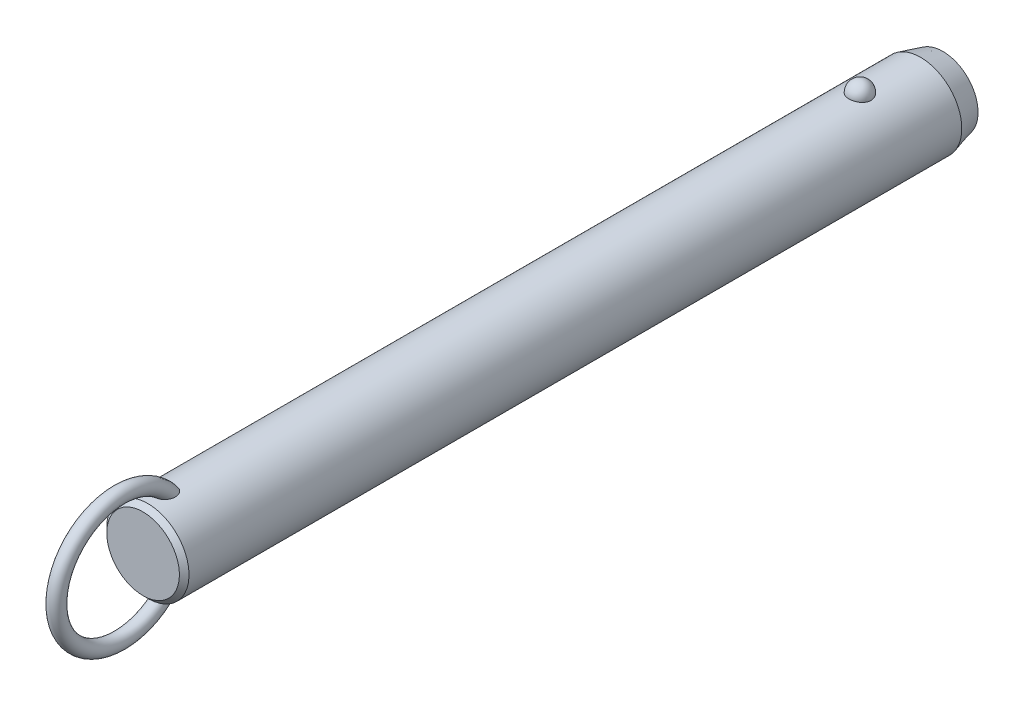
ISO-10303-21;
HEADER;
FILE_DESCRIPTION(('STEP AP214'),'2;1');
FILE_NAME('part.step','',(''),(''),'','','');
FILE_SCHEMA(('AUTOMOTIVE_DESIGN { 1 0 10303 214 1 1 1 1 }'));
ENDSEC;
DATA;
#1=APPLICATION_CONTEXT('core data for automotive mechanical design processes');
#2=APPLICATION_PROTOCOL_DEFINITION('international standard','automotive_design',2000,#1);
#3=PRODUCT_CONTEXT('',#1,'mechanical');
#4=PRODUCT('Part','Part','',(#3));
#5=PRODUCT_RELATED_PRODUCT_CATEGORY('part','',(#4));
#6=PRODUCT_DEFINITION_FORMATION('','',#4);
#7=PRODUCT_DEFINITION_CONTEXT('part definition',#1,'design');
#8=PRODUCT_DEFINITION('design','',#6,#7);
#9=PRODUCT_DEFINITION_SHAPE('','',#8);
#10=(LENGTH_UNIT() NAMED_UNIT(*) SI_UNIT(.MILLI.,.METRE.));
#11=(NAMED_UNIT(*) PLANE_ANGLE_UNIT() SI_UNIT($,.RADIAN.));
#12=(NAMED_UNIT(*) SI_UNIT($,.STERADIAN.) SOLID_ANGLE_UNIT());
#13=UNCERTAINTY_MEASURE_WITH_UNIT(LENGTH_MEASURE(1.E-05),#10,'distance_accuracy_value','');
#14=(GEOMETRIC_REPRESENTATION_CONTEXT(3) GLOBAL_UNCERTAINTY_ASSIGNED_CONTEXT((#13)) GLOBAL_UNIT_ASSIGNED_CONTEXT((#10,
#11,#12)) REPRESENTATION_CONTEXT('',''));
#15=CARTESIAN_POINT('',(0.,0.,0.));
#16=DIRECTION('',(0.,0.,1.));
#17=DIRECTION('',(1.,0.,0.));
#18=AXIS2_PLACEMENT_3D('',#15,#16,#17);
#19=CARTESIAN_POINT('',(0.,0.,177.8));
#20=DIRECTION('',(0.,0.,-1.));
#21=DIRECTION('',(-1.,0.,0.));
#22=AXIS2_PLACEMENT_3D('',#19,#20,#21);
#23=CYLINDRICAL_SURFACE('',#22,11.1);
#24=CARTESIAN_POINT('',(2.9724815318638,10.6945945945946,-3.00000000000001));
#25=CARTESIAN_POINT('',(2.97247830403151,10.6945972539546,-2.8322505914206));
#26=CARTESIAN_POINT('',(2.95876598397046,10.6984356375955,-2.66445972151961));
#27=CARTESIAN_POINT('',(2.90424529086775,10.7133624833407,-2.3336238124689));
#28=CARTESIAN_POINT('',(2.8634252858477,10.7244540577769,-2.17058084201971));
#29=CARTESIAN_POINT('',(2.75573657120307,10.7526272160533,-1.85396767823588));
#30=CARTESIAN_POINT('',(2.68887937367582,10.7697061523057,-1.70039333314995));
#31=CARTESIAN_POINT('',(2.53079696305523,10.8079438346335,-1.4069159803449));
#32=CARTESIAN_POINT('',(2.43957264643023,10.8291024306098,-1.26701246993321));
#33=CARTESIAN_POINT('',(2.23458150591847,10.8732541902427,-1.00409565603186));
#34=CARTESIAN_POINT('',(2.12071295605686,10.8962553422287,-0.881162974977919));
#35=CARTESIAN_POINT('',(1.87365402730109,10.9414421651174,-0.656352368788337));
#36=CARTESIAN_POINT('',(1.74046358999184,10.9636278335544,-0.554474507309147));
#37=CARTESIAN_POINT('',(1.45872188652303,11.0046495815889,-0.374872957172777));
#38=CARTESIAN_POINT('',(1.31021276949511,11.0234944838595,-0.297085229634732));
#39=CARTESIAN_POINT('',(1.00170030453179,11.0557957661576,-0.167529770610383));
#40=CARTESIAN_POINT('',(0.841698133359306,11.0692526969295,-0.1157593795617));
#41=CARTESIAN_POINT('',(0.517607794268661,11.0890932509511,-0.0403925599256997));
#42=CARTESIAN_POINT('',(0.353633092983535,11.0955916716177,-0.0163383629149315));
#43=CARTESIAN_POINT('',(0.0238420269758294,11.1011989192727,0.00445177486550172));
#44=CARTESIAN_POINT('',(-0.141974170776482,11.1003084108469,0.00119017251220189));
#45=CARTESIAN_POINT('',(-0.468405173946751,11.0912990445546,-0.0323233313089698));
#46=CARTESIAN_POINT('',(-0.629059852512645,11.0832767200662,-0.062214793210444));
#47=CARTESIAN_POINT('',(-0.942937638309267,11.0609962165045,-0.147645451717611));
#48=CARTESIAN_POINT('',(-1.09616062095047,11.0467379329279,-0.203185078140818));
#49=CARTESIAN_POINT('',(-1.39181061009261,11.0134071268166,-0.338752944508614));
#50=CARTESIAN_POINT('',(-1.53417383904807,10.9943086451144,-0.418913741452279));
#51=CARTESIAN_POINT('',(-1.80342160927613,10.9533667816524,-0.601448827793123));
#52=CARTESIAN_POINT('',(-1.9303046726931,10.9315231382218,-0.703825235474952));
#53=CARTESIAN_POINT('',(-2.16747598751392,10.887005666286,-0.930091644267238));
#54=CARTESIAN_POINT('',(-2.27742774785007,10.8643239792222,-1.05433291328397));
#55=CARTESIAN_POINT('',(-2.47517316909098,10.8209886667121,-1.31966633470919));
#56=CARTESIAN_POINT('',(-2.56296538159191,10.8003351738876,-1.46075958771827));
#57=CARTESIAN_POINT('',(-2.71500300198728,10.7631304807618,-1.75753646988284));
#58=CARTESIAN_POINT('',(-2.77898901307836,10.7466250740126,-1.91335887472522));
#59=CARTESIAN_POINT('',(-2.88046189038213,10.7198747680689,-2.23391529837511));
#60=CARTESIAN_POINT('',(-2.91794947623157,10.709629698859,-2.3986490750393));
#61=CARTESIAN_POINT('',(-2.96537819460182,10.6965949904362,-2.73165170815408));
#62=CARTESIAN_POINT('',(-2.97542891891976,10.693775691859,-2.89990378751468));
#63=CARTESIAN_POINT('',(-2.96804271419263,10.6958279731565,-3.23575286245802));
#64=CARTESIAN_POINT('',(-2.95060646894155,10.7006993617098,-3.4033498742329));
#65=CARTESIAN_POINT('',(-2.88883358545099,10.71753912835,-3.73233906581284));
#66=CARTESIAN_POINT('',(-2.84462026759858,10.7294749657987,-3.89375610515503));
#67=CARTESIAN_POINT('',(-2.73050447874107,10.7590797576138,-4.20667949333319));
#68=CARTESIAN_POINT('',(-2.66060103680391,10.7767489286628,-4.35818546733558));
#69=CARTESIAN_POINT('',(-2.49642559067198,10.8159599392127,-4.64785421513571));
#70=CARTESIAN_POINT('',(-2.40203047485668,10.8375211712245,-4.78594458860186));
#71=CARTESIAN_POINT('',(-2.19143488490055,10.8820570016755,-5.04410382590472));
#72=CARTESIAN_POINT('',(-2.07523364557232,10.9050316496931,-5.16417205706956));
#73=CARTESIAN_POINT('',(-1.82361254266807,10.9499219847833,-5.3833483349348));
#74=CARTESIAN_POINT('',(-1.68812945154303,10.9718338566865,-5.48238464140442));
#75=CARTESIAN_POINT('',(-1.40191298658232,11.0120611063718,-5.65618873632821));
#76=CARTESIAN_POINT('',(-1.25118062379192,11.0303767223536,-5.73095813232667));
#77=CARTESIAN_POINT('',(-0.940570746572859,11.0611653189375,-5.85334725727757));
#78=CARTESIAN_POINT('',(-0.780821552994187,11.0737044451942,-5.90127578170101));
#79=CARTESIAN_POINT('',(-0.455204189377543,11.0918598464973,-5.96992976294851));
#80=CARTESIAN_POINT('',(-0.289336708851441,11.0974768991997,-5.99065827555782));
#81=CARTESIAN_POINT('',(0.0406846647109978,11.1011307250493,-6.00418773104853));
#82=CARTESIAN_POINT('',(0.204817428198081,11.099299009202,-5.9974731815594));
#83=CARTESIAN_POINT('',(0.5295530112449,11.088551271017,-5.95740317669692));
#84=CARTESIAN_POINT('',(0.69015594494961,11.0796354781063,-5.92404858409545));
#85=CARTESIAN_POINT('',(1.0027760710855,11.0557204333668,-5.83180084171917));
#86=CARTESIAN_POINT('',(1.15482001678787,11.0407414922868,-5.7729929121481));
#87=CARTESIAN_POINT('',(1.44678373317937,11.0062913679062,-5.63147366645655));
#88=CARTESIAN_POINT('',(1.58670279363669,10.9868199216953,-5.54876095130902));
#89=CARTESIAN_POINT('',(1.8527023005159,10.9451315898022,-5.36027644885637));
#90=CARTESIAN_POINT('',(1.97855158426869,10.9228788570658,-5.25418644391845));
#91=CARTESIAN_POINT('',(2.21080872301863,10.8782509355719,-5.02251354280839));
#92=CARTESIAN_POINT('',(2.31721312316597,10.8558757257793,-4.89692718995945));
#93=CARTESIAN_POINT('',(2.5094551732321,10.8130715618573,-4.62745408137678));
#94=CARTESIAN_POINT('',(2.59493284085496,10.7926798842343,-4.48330448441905));
#95=CARTESIAN_POINT('',(2.740862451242,10.7565495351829,-4.18236358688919));
#96=CARTESIAN_POINT('',(2.80132490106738,10.7408089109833,-4.02557762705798));
#97=CARTESIAN_POINT('',(2.88959070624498,10.7173718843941,-3.72475308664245));
#98=CARTESIAN_POINT('',(2.92062102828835,10.7088950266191,-3.58171216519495));
#99=CARTESIAN_POINT('',(2.96206765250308,10.6975052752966,-3.29245795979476));
#100=CARTESIAN_POINT('',(2.97248434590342,10.6945922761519,-3.14624473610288));
#101=CARTESIAN_POINT('',(2.9724815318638,10.6945945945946,-3.00000000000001));
#102=B_SPLINE_CURVE_WITH_KNOTS('',3,(#24,#25,#26,#27,#28,#29,#30,#31,#32,#33,#34,#35,#36,#37,
#38,#39,#40,#41,#42,#43,#44,#45,#46,#47,#48,#49,#50,#51,#52,#53,#54,#55,#56,#57,#58,#59,#60,#61,
#62,#63,#64,#65,#66,#67,#68,#69,#70,#71,#72,#73,#74,#75,#76,#77,#78,#79,#80,#81,#82,#83,#84,#85,
#86,#87,#88,#89,#90,#91,#92,#93,#94,#95,#96,#97,#98,#99,#100,#101),.UNSPECIFIED.,.T.,.F.,(4,2,2,
2,2,2,2,2,2,2,2,2,2,2,2,2,2,2,2,2,2,2,2,2,2,2,2,2,2,2,2,2,2,2,2,2,2,2,4),(0.,0.502722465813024,
1.00566079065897,1.5083769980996,2.01107471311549,2.51608392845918,3.02109467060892,
3.52475118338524,4.02835620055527,4.523518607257,5.0186364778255,5.50715297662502,
5.9956776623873,6.48688002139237,6.97812923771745,7.47814366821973,7.9781907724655,
8.48353712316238,8.9888697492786,9.49218093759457,9.99547960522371,10.4964777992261,
10.997494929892,11.5010810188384,12.0046847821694,12.5099796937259,13.0152411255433,
13.5145635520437,14.0138298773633,14.5043200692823,14.9947943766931,15.4836390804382,
15.9725123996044,16.4685040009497,16.9645836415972,17.4686765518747,17.972557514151,
18.410841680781,18.849117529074),.UNSPECIFIED.);
#103=CARTESIAN_POINT('',(2.9724815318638,10.6945945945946,-3.00000000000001));
#104=VERTEX_POINT('',#103);
#105=EDGE_CURVE('E41',#104,#104,#102,.T.);
#106=ORIENTED_EDGE('',*,*,#105,.T.);
#107=EDGE_LOOP('',(#106));
#108=FACE_BOUND('',#107,.T.);
#109=CARTESIAN_POINT('',(0.,0.,189.2));
#110=DIRECTION('',(0.,0.,1.));
#111=DIRECTION('',(1.,0.,0.));
#112=AXIS2_PLACEMENT_3D('',#109,#110,#111);
#113=CIRCLE('',#112,11.1);
#114=CARTESIAN_POINT('',(-11.1,0.,189.2));
#115=VERTEX_POINT('',#114);
#116=EDGE_CURVE('E10',#115,#115,#113,.F.);
#117=ORIENTED_EDGE('',*,*,#116,.T.);
#118=EDGE_LOOP('',(#117));
#119=FACE_BOUND('',#118,.T.);
#120=CARTESIAN_POINT('',(-0.564520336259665,-11.0856356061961,181.457815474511));
#121=CARTESIAN_POINT('',(-0.667202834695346,-11.0804062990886,181.491283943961));
#122=CARTESIAN_POINT('',(-0.766875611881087,-11.0738877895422,181.533835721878));
#123=CARTESIAN_POINT('',(-0.95728412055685,-11.0590576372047,181.635419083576));
#124=CARTESIAN_POINT('',(-1.04801616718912,-11.0507452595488,181.69445742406));
#125=CARTESIAN_POINT('',(-1.21800952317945,-11.0333016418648,181.826529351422));
#126=CARTESIAN_POINT('',(-1.2973080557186,-11.0241732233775,181.899515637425));
#127=CARTESIAN_POINT('',(-1.44337665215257,-11.0060026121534,182.057037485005));
#128=CARTESIAN_POINT('',(-1.51014622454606,-10.9969604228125,182.141573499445));
#129=CARTESIAN_POINT('',(-1.63454620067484,-10.9791841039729,182.325521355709));
#130=CARTESIAN_POINT('',(-1.69127003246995,-10.9705107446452,182.425549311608));
#131=CARTESIAN_POINT('',(-1.7898078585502,-10.9548648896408,182.632790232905));
#132=CARTESIAN_POINT('',(-1.83161214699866,-10.9478935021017,182.740007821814));
#133=CARTESIAN_POINT('',(-1.91557028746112,-10.9335803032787,183.005408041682));
#134=CARTESIAN_POINT('',(-1.95040620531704,-10.9273269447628,183.165980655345));
#135=CARTESIAN_POINT('',(-1.99388326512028,-10.9194709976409,183.490697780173));
#136=CARTESIAN_POINT('',(-2.00248051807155,-10.9178762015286,183.654847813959));
#137=CARTESIAN_POINT('',(-1.99551615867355,-10.9191578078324,184.024650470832));
#138=CARTESIAN_POINT('',(-1.9732206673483,-10.9232807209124,184.230191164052));
#139=CARTESIAN_POINT('',(-1.9152976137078,-10.9335244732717,184.533595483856));
#140=CARTESIAN_POINT('',(-1.89184575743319,-10.9376266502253,184.634088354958));
#141=CARTESIAN_POINT('',(-1.83700674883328,-10.9469720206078,184.832855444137));
#142=CARTESIAN_POINT('',(-1.80562070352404,-10.9522150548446,184.931129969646));
#143=CARTESIAN_POINT('',(-1.73463055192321,-10.9636837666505,185.125914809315));
#144=CARTESIAN_POINT('',(-1.69493416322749,-10.9699202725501,185.222390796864));
#145=CARTESIAN_POINT('',(-1.60745141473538,-10.9830806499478,185.411626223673));
#146=CARTESIAN_POINT('',(-1.55966150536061,-10.9900048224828,185.504384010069));
#147=CARTESIAN_POINT('',(-1.45591812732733,-11.0042280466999,185.684690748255));
#148=CARTESIAN_POINT('',(-1.40000013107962,-11.0115253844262,185.772260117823));
#149=CARTESIAN_POINT('',(-1.27937470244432,-11.0261911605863,185.941029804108));
#150=CARTESIAN_POINT('',(-1.21467835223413,-11.0335594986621,186.02223795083));
#151=CARTESIAN_POINT('',(-1.08218150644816,-11.0473027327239,186.169001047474));
#152=CARTESIAN_POINT('',(-1.01522633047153,-11.0537063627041,186.235309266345));
#153=CARTESIAN_POINT('',(-0.872952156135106,-11.065850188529,186.358378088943));
#154=CARTESIAN_POINT('',(-0.797642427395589,-11.0715911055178,186.415149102));
#155=CARTESIAN_POINT('',(-0.651396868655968,-11.081071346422,186.507515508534));
#156=CARTESIAN_POINT('',(-0.581712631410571,-11.0849841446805,186.545049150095));
#157=CARTESIAN_POINT('',(-0.43706608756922,-11.0916271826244,186.608259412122));
#158=CARTESIAN_POINT('',(-0.362109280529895,-11.0943586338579,186.633948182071));
#159=CARTESIAN_POINT('',(-0.207828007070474,-11.0983242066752,186.671117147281));
#160=CARTESIAN_POINT('',(-0.12846771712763,-11.0995432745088,186.682454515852));
#161=CARTESIAN_POINT('',(0.0309101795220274,-11.1002423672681,186.688965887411));
#162=CARTESIAN_POINT('',(0.110927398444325,-11.0997233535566,186.684148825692));
#163=CARTESIAN_POINT('',(0.25640659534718,-11.097240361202,186.660959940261));
#164=CARTESIAN_POINT('',(0.322235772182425,-11.0955074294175,186.644754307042));
#165=CARTESIAN_POINT('',(0.450635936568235,-11.0910350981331,186.602600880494));
#166=CARTESIAN_POINT('',(0.513205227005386,-11.0882951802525,186.576648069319));
#167=CARTESIAN_POINT('',(0.662626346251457,-11.0805620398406,186.502607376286));
#168=CARTESIAN_POINT('',(0.747127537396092,-11.0751144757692,186.449845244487));
#169=CARTESIAN_POINT('',(0.906756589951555,-11.0631932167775,186.331720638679));
#170=CARTESIAN_POINT('',(0.981859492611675,-11.0567168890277,186.266325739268));
#171=CARTESIAN_POINT('',(1.10712207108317,-11.0447856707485,186.14226337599));
#172=CARTESIAN_POINT('',(1.15909566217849,-11.0394280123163,186.085383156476));
#173=CARTESIAN_POINT('',(1.2579192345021,-11.0286040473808,185.967327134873));
#174=CARTESIAN_POINT('',(1.30476642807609,-11.0231376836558,185.906149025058));
#175=CARTESIAN_POINT('',(1.43818612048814,-11.0068027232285,185.717305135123));
#176=CARTESIAN_POINT('',(1.51751767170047,-10.9960104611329,185.584453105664));
#177=CARTESIAN_POINT('',(1.63597546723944,-10.9788847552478,185.353137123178));
#178=CARTESIAN_POINT('',(1.67988876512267,-10.9722190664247,185.257053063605));
#179=CARTESIAN_POINT('',(1.75953241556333,-10.9597298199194,185.061431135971));
#180=CARTESIAN_POINT('',(1.7952596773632,-10.9539065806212,184.961891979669));
#181=CARTESIAN_POINT('',(1.85844731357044,-10.9433632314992,184.76021118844));
#182=CARTESIAN_POINT('',(1.88591073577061,-10.9386427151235,184.65807052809));
#183=CARTESIAN_POINT('',(1.93234324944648,-10.9305350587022,184.451819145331));
#184=CARTESIAN_POINT('',(1.95131065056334,-10.9271481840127,184.347708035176));
#185=CARTESIAN_POINT('',(1.9904020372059,-10.9201183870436,184.065458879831));
#186=CARTESIAN_POINT('',(2.00221217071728,-10.9179256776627,183.886037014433));
#187=CARTESIAN_POINT('',(1.99711676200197,-10.9188636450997,183.527713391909));
#188=CARTESIAN_POINT('',(1.98026150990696,-10.9219849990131,183.348811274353));
#189=CARTESIAN_POINT('',(1.92151657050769,-10.9324473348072,183.03645144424));
#190=CARTESIAN_POINT('',(1.88605081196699,-10.9386915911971,182.901759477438));
#191=CARTESIAN_POINT('',(1.79393020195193,-10.9541780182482,182.639966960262));
#192=CARTESIAN_POINT('',(1.73729868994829,-10.9634168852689,182.512858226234));
#193=CARTESIAN_POINT('',(1.61237037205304,-10.9824218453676,182.289418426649));
#194=CARTESIAN_POINT('',(1.54715374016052,-10.9918945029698,182.191345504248));
#195=CARTESIAN_POINT('',(1.40127026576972,-11.0114415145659,182.007434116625));
#196=CARTESIAN_POINT('',(1.32060742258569,-11.0215157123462,181.921592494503));
#197=CARTESIAN_POINT('',(1.1447478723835,-11.041168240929,181.765163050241));
#198=CARTESIAN_POINT('',(1.04947805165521,-11.0507437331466,181.694656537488));
#199=CARTESIAN_POINT('',(0.847278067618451,-11.0680789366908,181.572640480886));
#200=CARTESIAN_POINT('',(0.740351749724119,-11.0758392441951,181.521124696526));
#201=CARTESIAN_POINT('',(0.529289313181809,-11.0878275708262,181.443485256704));
#202=CARTESIAN_POINT('',(0.425895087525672,-11.0923259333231,181.415377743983));
#203=CARTESIAN_POINT('',(0.215723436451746,-11.0984001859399,181.377703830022));
#204=CARTESIAN_POINT('',(0.10894793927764,-11.0999777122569,181.368127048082));
#205=CARTESIAN_POINT('',(-0.0938962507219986,-11.1000196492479,181.367877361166));
#206=CARTESIAN_POINT('',(-0.189967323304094,-11.0987797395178,181.375408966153));
#207=CARTESIAN_POINT('',(-0.379657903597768,-11.0939111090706,181.405507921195));
#208=CARTESIAN_POINT('',(-0.47327735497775,-11.0902823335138,181.428075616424));
#209=CARTESIAN_POINT('',(-0.564520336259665,-11.0856356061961,181.457815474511));
#210=B_SPLINE_CURVE_WITH_KNOTS('',3,(#120,#121,#122,#123,#124,#125,#126,#127,#128,#129,#130,
#131,#132,#133,#134,#135,#136,#137,#138,#139,#140,#141,#142,#143,#144,#145,#146,#147,#148,#149,
#150,#151,#152,#153,#154,#155,#156,#157,#158,#159,#160,#161,#162,#163,#164,#165,#166,#167,#168,
#169,#170,#171,#172,#173,#174,#175,#176,#177,#178,#179,#180,#181,#182,#183,#184,#185,#186,#187,
#188,#189,#190,#191,#192,#193,#194,#195,#196,#197,#198,#199,#200,#201,#202,#203,#204,#205,#206,
#207,#208,#209),.UNSPECIFIED.,.T.,.F.,(4,2,2,2,2,2,2,2,2,2,2,2,2,2,2,2,2,2,2,2,2,2,2,2,2,2,2,2,
2,2,2,2,2,2,2,2,2,2,2,2,2,2,2,2,4),(0.,0.323999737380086,0.64813245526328,0.971184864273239,
1.29424994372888,1.63886237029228,1.98369857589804,2.47426059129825,2.96564271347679,
3.58257396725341,3.89215258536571,4.20168803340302,4.51486273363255,4.82817514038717,
5.14015911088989,5.45175282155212,5.73442856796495,6.01679375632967,6.2536458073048,
6.49025437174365,6.72919963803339,6.96801276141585,7.17061258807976,7.37331685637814,
7.67094989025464,7.96935728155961,8.20075067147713,8.43226927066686,8.89581623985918,
9.21306533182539,9.53043400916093,9.84768549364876,10.1650000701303,10.7022930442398,
11.2386443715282,11.655339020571,12.071575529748,12.4245637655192,12.7774607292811,
13.1321855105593,13.4867936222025,13.8068771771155,14.1267813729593,14.4146787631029,
14.7025827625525),.UNSPECIFIED.);
#211=CARTESIAN_POINT('',(-0.564520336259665,-11.0856356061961,181.457815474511));
#212=VERTEX_POINT('',#211);
#213=EDGE_CURVE('E59',#212,#212,#210,.T.);
#214=ORIENTED_EDGE('',*,*,#213,.T.);
#215=EDGE_LOOP('',(#214));
#216=FACE_BOUND('',#215,.T.);
#217=CARTESIAN_POINT('',(-0.564520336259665,11.0856356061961,181.457815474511));
#218=CARTESIAN_POINT('',(-0.468542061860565,11.0905203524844,181.426545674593));
#219=CARTESIAN_POINT('',(-0.369793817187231,11.0942886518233,181.403157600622));
#220=CARTESIAN_POINT('',(-0.169555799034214,11.0991586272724,181.373085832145));
#221=CARTESIAN_POINT('',(-0.0680604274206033,11.1002543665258,181.36643932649));
#222=CARTESIAN_POINT('',(0.134549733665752,11.099646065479,181.370157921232));
#223=CARTESIAN_POINT('',(0.235664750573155,11.0979441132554,181.38051033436));
#224=CARTESIAN_POINT('',(0.434632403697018,11.0919342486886,181.417831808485));
#225=CARTESIAN_POINT('',(0.532486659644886,11.0876276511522,181.444792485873));
#226=CARTESIAN_POINT('',(0.722445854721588,11.0768742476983,181.5144096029));
#227=CARTESIAN_POINT('',(0.814543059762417,11.0704246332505,181.557086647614));
#228=CARTESIAN_POINT('',(0.990565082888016,11.0560659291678,181.656648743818));
#229=CARTESIAN_POINT('',(1.07448844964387,11.048156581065,181.713536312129));
#230=CARTESIAN_POINT('',(1.23562672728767,11.0313221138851,181.842210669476));
#231=CARTESIAN_POINT('',(1.3124268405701,11.0223686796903,181.914511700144));
#232=CARTESIAN_POINT('',(1.45398030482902,11.0045918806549,182.070042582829));
#233=CARTESIAN_POINT('',(1.51873073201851,10.9957685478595,182.153275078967));
#234=CARTESIAN_POINT('',(1.64107232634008,10.9782087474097,182.336384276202));
#235=CARTESIAN_POINT('',(1.6974317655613,10.9695572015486,182.437089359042));
#236=CARTESIAN_POINT('',(1.79515063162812,10.9539887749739,182.645626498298));
#237=CARTESIAN_POINT('',(1.83649966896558,10.9470730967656,182.75346343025));
#238=CARTESIAN_POINT('',(1.91931148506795,10.9329211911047,183.020399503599));
#239=CARTESIAN_POINT('',(1.95340104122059,10.9267904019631,183.181861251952));
#240=CARTESIAN_POINT('',(1.99526195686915,10.9192174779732,183.50821631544));
#241=CARTESIAN_POINT('',(2.00298989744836,10.9177830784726,183.67311484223));
#242=CARTESIAN_POINT('',(1.99396251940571,10.9194420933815,184.044100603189));
#243=CARTESIAN_POINT('',(1.97050829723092,10.923774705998,184.25003871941));
#244=CARTESIAN_POINT('',(1.91079643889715,10.9343131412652,184.553901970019));
#245=CARTESIAN_POINT('',(1.88673702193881,10.9385106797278,184.654529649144));
#246=CARTESIAN_POINT('',(1.8306550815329,10.9480376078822,184.853510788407));
#247=CARTESIAN_POINT('',(1.79863369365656,10.9533668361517,184.951864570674));
#248=CARTESIAN_POINT('',(1.72633365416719,10.9649954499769,185.146720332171));
#249=CARTESIAN_POINT('',(1.68596409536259,10.9713053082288,185.24318790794));
#250=CARTESIAN_POINT('',(1.59707998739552,10.9845964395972,185.432323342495));
#251=CARTESIAN_POINT('',(1.54856169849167,10.9915780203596,185.524989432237));
#252=CARTESIAN_POINT('',(1.44330168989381,11.0058935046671,185.704975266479));
#253=CARTESIAN_POINT('',(1.3865974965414,11.0132257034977,185.792316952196));
#254=CARTESIAN_POINT('',(1.2643115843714,11.0279330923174,185.960456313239));
#255=CARTESIAN_POINT('',(1.19874160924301,11.0353082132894,186.041262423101));
#256=CARTESIAN_POINT('',(1.06542088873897,11.048931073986,186.185985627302));
#257=CARTESIAN_POINT('',(0.998640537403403,11.0552153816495,186.250784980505));
#258=CARTESIAN_POINT('',(0.856896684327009,11.0671032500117,186.370846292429));
#259=CARTESIAN_POINT('',(0.781942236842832,11.0727075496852,186.426118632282));
#260=CARTESIAN_POINT('',(0.636276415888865,11.081949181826,186.515972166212));
#261=CARTESIAN_POINT('',(0.566755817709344,11.0857572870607,186.552441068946));
#262=CARTESIAN_POINT('',(0.422602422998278,11.0921860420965,186.613533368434));
#263=CARTESIAN_POINT('',(0.347974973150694,11.0948079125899,186.638168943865));
#264=CARTESIAN_POINT('',(0.194593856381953,11.0985608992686,186.673323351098));
#265=CARTESIAN_POINT('',(0.115807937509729,11.0996777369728,186.683706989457));
#266=CARTESIAN_POINT('',(-0.0422499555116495,11.1002003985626,186.688574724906));
#267=CARTESIAN_POINT('',(-0.121521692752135,11.09960699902,186.683066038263));
#268=CARTESIAN_POINT('',(-0.266046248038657,11.0970123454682,186.658827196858));
#269=CARTESIAN_POINT('',(-0.331661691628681,11.0952283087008,186.642135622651));
#270=CARTESIAN_POINT('',(-0.459588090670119,11.0906663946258,186.599111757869));
#271=CARTESIAN_POINT('',(-0.52189737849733,11.0878880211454,186.572774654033));
#272=CARTESIAN_POINT('',(-0.671446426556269,11.0800342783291,186.497513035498));
#273=CARTESIAN_POINT('',(-0.756250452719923,11.0744969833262,186.443818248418));
#274=CARTESIAN_POINT('',(-0.916349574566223,11.0624045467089,186.323802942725));
#275=CARTESIAN_POINT('',(-0.991618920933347,11.0558467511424,186.257449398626));
#276=CARTESIAN_POINT('',(-1.11713140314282,11.0437783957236,186.131633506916));
#277=CARTESIAN_POINT('',(-1.1692053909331,11.0383619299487,186.073952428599));
#278=CARTESIAN_POINT('',(-1.26817476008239,11.02743010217,185.954280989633));
#279=CARTESIAN_POINT('',(-1.31506731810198,11.0219146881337,185.892288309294));
#280=CARTESIAN_POINT('',(-1.40399813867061,11.0109399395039,185.764784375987));
#281=CARTESIAN_POINT('',(-1.44602864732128,11.0054807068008,185.699267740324));
#282=CARTESIAN_POINT('',(-1.52538779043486,10.9947621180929,185.565422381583));
#283=CARTESIAN_POINT('',(-1.56271516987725,10.9895028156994,185.497092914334));
#284=CARTESIAN_POINT('',(-1.64537943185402,10.9774790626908,185.333210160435));
#285=CARTESIAN_POINT('',(-1.68879497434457,10.9708503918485,185.2366735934));
#286=CARTESIAN_POINT('',(-1.76740738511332,10.9584602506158,185.040236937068));
#287=CARTESIAN_POINT('',(-1.80260120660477,10.95269910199,184.94033561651));
#288=CARTESIAN_POINT('',(-1.86468657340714,10.9423003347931,184.737966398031));
#289=CARTESIAN_POINT('',(-1.8915816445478,10.9376622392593,184.635499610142));
#290=CARTESIAN_POINT('',(-1.93682458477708,10.9297405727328,184.428642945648));
#291=CARTESIAN_POINT('',(-1.95517082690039,10.9264572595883,184.324252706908));
#292=CARTESIAN_POINT('',(-1.99232562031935,10.9197647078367,184.04262876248));
#293=CARTESIAN_POINT('',(-2.00294603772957,10.9177914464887,183.864185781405));
#294=CARTESIAN_POINT('',(-1.99566675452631,10.9191290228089,183.507996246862));
#295=CARTESIAN_POINT('',(-1.97781651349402,10.9224306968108,183.33024902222));
#296=CARTESIAN_POINT('',(-1.91747214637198,10.9331592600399,183.019792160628));
#297=CARTESIAN_POINT('',(-1.88131022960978,10.9395108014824,182.885825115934));
#298=CARTESIAN_POINT('',(-1.78790380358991,10.9551659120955,182.62559757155));
#299=CARTESIAN_POINT('',(-1.73068309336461,10.9644661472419,182.499328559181));
#300=CARTESIAN_POINT('',(-1.60475573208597,10.9835398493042,182.27741565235));
#301=CARTESIAN_POINT('',(-1.53908879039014,10.9930297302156,182.180026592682));
#302=CARTESIAN_POINT('',(-1.39238608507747,11.0125708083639,181.997525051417));
#303=CARTESIAN_POINT('',(-1.31135150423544,11.0226219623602,181.912411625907));
#304=CARTESIAN_POINT('',(-1.14382035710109,11.0411991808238,181.76529943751));
#305=CARTESIAN_POINT('',(-1.0585850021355,11.0497792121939,181.70186930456));
#306=CARTESIAN_POINT('',(-0.878723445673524,11.0655285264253,181.590250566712));
#307=CARTESIAN_POINT('',(-0.784123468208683,11.0727015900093,181.542020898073));
#308=CARTESIAN_POINT('',(-0.646163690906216,11.0812501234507,181.486023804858));
#309=CARTESIAN_POINT('',(-0.605595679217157,11.0835451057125,181.471197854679));
#310=CARTESIAN_POINT('',(-0.564520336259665,11.0856356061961,181.457815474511));
#311=B_SPLINE_CURVE_WITH_KNOTS('',3,(#217,#218,#219,#220,#221,#222,#223,#224,#225,#226,#227,
#228,#229,#230,#231,#232,#233,#234,#235,#236,#237,#238,#239,#240,#241,#242,#243,#244,#245,#246,
#247,#248,#249,#250,#251,#252,#253,#254,#255,#256,#257,#258,#259,#260,#261,#262,#263,#264,#265,
#266,#267,#268,#269,#270,#271,#272,#273,#274,#275,#276,#277,#278,#279,#280,#281,#282,#283,#284,
#285,#286,#287,#288,#289,#290,#291,#292,#293,#294,#295,#296,#297,#298,#299,#300,#301,#302,#303,
#304,#305,#306,#307,#308,#309,#310),.UNSPECIFIED.,.T.,.F.,(4,2,2,2,2,2,2,2,2,2,2,2,2,2,2,2,2,2,
2,2,2,2,2,2,2,2,2,2,2,2,2,2,2,2,2,2,2,2,2,2,2,2,2,2,2,2,4),(0.,0.303061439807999,
0.606795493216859,0.910302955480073,1.21365733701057,1.51741085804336,1.82121821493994,
2.13745205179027,2.45376252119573,2.79958678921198,3.14564996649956,3.63832391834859,
4.13180893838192,4.75031912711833,5.06071926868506,5.37107516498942,5.6850077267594,
5.99908475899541,6.31176519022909,6.62403542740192,6.90315673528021,7.18197194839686,
7.41687778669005,7.65154134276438,7.88841587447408,8.12518286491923,8.32752842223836,
8.52997509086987,8.82986421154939,9.13054668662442,9.36393502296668,9.59744991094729,
9.83133221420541,10.0652767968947,10.383032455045,10.7009056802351,11.0186436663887,
11.3364420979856,11.8705925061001,12.4038159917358,12.8189662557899,13.2336487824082,
13.5857049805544,13.9377340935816,14.2561354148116,14.5736690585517,14.7033687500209),.UNSPECIFIED.);
#312=CARTESIAN_POINT('',(-0.564520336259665,11.0856356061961,181.457815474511));
#313=VERTEX_POINT('',#312);
#314=EDGE_CURVE('E67',#313,#313,#311,.T.);
#315=ORIENTED_EDGE('',*,*,#314,.T.);
#316=EDGE_LOOP('',(#315));
#317=FACE_BOUND('',#316,.T.);
#318=CARTESIAN_POINT('',(0.,0.,-19.4));
#319=DIRECTION('',(0.,0.,-1.));
#320=DIRECTION('',(-1.,0.,0.));
#321=AXIS2_PLACEMENT_3D('',#318,#319,#320);
#322=CIRCLE('',#321,11.1);
#323=CARTESIAN_POINT('',(-11.1,0.,-19.4));
#324=VERTEX_POINT('',#323);
#325=EDGE_CURVE('E56',#324,#324,#322,.F.);
#326=ORIENTED_EDGE('',*,*,#325,.T.);
#327=EDGE_LOOP('',(#326));
#328=FACE_BOUND('',#327,.T.);
#329=ADVANCED_FACE('F37',(#108,#119,#216,#317,#328),#23,.T.);
#330=CARTESIAN_POINT('',(0.,0.,-25.4));
#331=DIRECTION('',(0.,0.,-1.));
#332=DIRECTION('',(-1.,0.,0.));
#333=AXIS2_PLACEMENT_3D('',#330,#331,#332);
#334=PLANE('',#333);
#335=CARTESIAN_POINT('',(0.,0.,-25.4));
#336=DIRECTION('',(0.,0.,-1.));
#337=DIRECTION('',(-1.,0.,0.));
#338=AXIS2_PLACEMENT_3D('',#335,#336,#337);
#339=CIRCLE('',#338,9.49230484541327);
#340=CARTESIAN_POINT('',(-9.49230484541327,0.,-25.4));
#341=VERTEX_POINT('',#340);
#342=EDGE_CURVE('E66',#341,#341,#339,.T.);
#343=ORIENTED_EDGE('',*,*,#342,.T.);
#344=EDGE_LOOP('',(#343));
#345=FACE_BOUND('',#344,.T.);
#346=ADVANCED_FACE('F85',(#345),#334,.T.);
#347=CARTESIAN_POINT('',(0.,0.,-25.4));
#348=DIRECTION('',(0.,0.,1.));
#349=DIRECTION('',(1.,0.,0.));
#350=AXIS2_PLACEMENT_3D('',#347,#348,#349);
#351=CONICAL_SURFACE('',#350,9.49230484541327,0.261799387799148);
#352=ORIENTED_EDGE('',*,*,#325,.F.);
#353=EDGE_LOOP('',(#352));
#354=FACE_BOUND('',#353,.T.);
#355=ORIENTED_EDGE('',*,*,#342,.F.);
#356=EDGE_LOOP('',(#355));
#357=FACE_BOUND('',#356,.T.);
#358=ADVANCED_FACE('F83',(#354,#357),#351,.T.);
#359=CARTESIAN_POINT('',(0.,0.,190.5));
#360=DIRECTION('',(0.,0.,1.));
#361=DIRECTION('',(1.,0.,0.));
#362=AXIS2_PLACEMENT_3D('',#359,#360,#361);
#363=PLANE('',#362);
#364=CARTESIAN_POINT('',(0.,0.,190.5));
#365=DIRECTION('',(0.,0.,1.));
#366=DIRECTION('',(1.,0.,0.));
#367=AXIS2_PLACEMENT_3D('',#364,#365,#366);
#368=CIRCLE('',#367,9.80000000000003);
#369=CARTESIAN_POINT('',(-9.80000000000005,0.,190.5));
#370=VERTEX_POINT('',#369);
#371=EDGE_CURVE('E50',#370,#370,#368,.T.);
#372=ORIENTED_EDGE('',*,*,#371,.T.);
#373=EDGE_LOOP('',(#372));
#374=FACE_BOUND('',#373,.T.);
#375=ADVANCED_FACE('F77',(#374),#363,.T.);
#376=CARTESIAN_POINT('',(0.,0.,196.85));
#377=DIRECTION('',(1.,0.,0.));
#378=DIRECTION('',(0.,0.,-1.));
#379=AXIS2_PLACEMENT_3D('',#376,#377,#378);
#380=TOROIDAL_SURFACE('',#379,17.05,2.);
#381=ORIENTED_EDGE('',*,*,#314,.F.);
#382=EDGE_LOOP('',(#381));
#383=FACE_BOUND('',#382,.T.);
#384=ORIENTED_EDGE('',*,*,#213,.F.);
#385=EDGE_LOOP('',(#384));
#386=FACE_BOUND('',#385,.T.);
#387=ADVANCED_FACE('F73',(#383,#386),#380,.T.);
#388=CARTESIAN_POINT('',(0.,0.,190.5));
#389=DIRECTION('',(0.,0.,-1.));
#390=DIRECTION('',(-1.,0.,0.));
#391=AXIS2_PLACEMENT_3D('',#388,#389,#390);
#392=CONICAL_SURFACE('',#391,9.80000000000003,0.785398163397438);
#393=CARTESIAN_POINT('',(-11.1,0.,189.2));
#394=CARTESIAN_POINT('',(-11.0864583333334,0.,189.213541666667));
#395=CARTESIAN_POINT('',(-11.0729166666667,0.,189.227083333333));
#396=CARTESIAN_POINT('',(-11.0458333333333,0.,189.254166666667));
#397=CARTESIAN_POINT('',(-11.0322916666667,0.,189.267708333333));
#398=CARTESIAN_POINT('',(-11.0052083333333,0.,189.294791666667));
#399=CARTESIAN_POINT('',(-10.9916666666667,0.,189.308333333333));
#400=CARTESIAN_POINT('',(-10.9645833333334,0.,189.335416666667));
#401=CARTESIAN_POINT('',(-10.9510416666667,0.,189.348958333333));
#402=CARTESIAN_POINT('',(-10.9239583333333,0.,189.376041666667));
#403=CARTESIAN_POINT('',(-10.9104166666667,0.,189.389583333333));
#404=CARTESIAN_POINT('',(-10.8833333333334,0.,189.416666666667));
#405=CARTESIAN_POINT('',(-10.8697916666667,0.,189.430208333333));
#406=CARTESIAN_POINT('',(-10.8427083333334,0.,189.457291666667));
#407=CARTESIAN_POINT('',(-10.8291666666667,0.,189.470833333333));
#408=CARTESIAN_POINT('',(-10.8020833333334,0.,189.497916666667));
#409=CARTESIAN_POINT('',(-10.7885416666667,0.,189.511458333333));
#410=CARTESIAN_POINT('',(-10.7614583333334,0.,189.538541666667));
#411=CARTESIAN_POINT('',(-10.7479166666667,0.,189.552083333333));
#412=CARTESIAN_POINT('',(-10.7208333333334,0.,189.579166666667));
#413=CARTESIAN_POINT('',(-10.7072916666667,0.,189.592708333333));
#414=CARTESIAN_POINT('',(-10.6802083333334,0.,189.619791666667));
#415=CARTESIAN_POINT('',(-10.6666666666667,0.,189.633333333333));
#416=CARTESIAN_POINT('',(-10.6395833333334,0.,189.660416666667));
#417=CARTESIAN_POINT('',(-10.6260416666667,0.,189.673958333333));
#418=CARTESIAN_POINT('',(-10.5989583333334,0.,189.701041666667));
#419=CARTESIAN_POINT('',(-10.5854166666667,0.,189.714583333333));
#420=CARTESIAN_POINT('',(-10.5583333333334,0.,189.741666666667));
#421=CARTESIAN_POINT('',(-10.5447916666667,0.,189.755208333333));
#422=CARTESIAN_POINT('',(-10.5177083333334,0.,189.782291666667));
#423=CARTESIAN_POINT('',(-10.5041666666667,0.,189.795833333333));
#424=CARTESIAN_POINT('',(-10.4770833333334,0.,189.822916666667));
#425=CARTESIAN_POINT('',(-10.4635416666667,0.,189.836458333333));
#426=CARTESIAN_POINT('',(-10.4364583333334,0.,189.863541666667));
#427=CARTESIAN_POINT('',(-10.4229166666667,0.,189.877083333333));
#428=CARTESIAN_POINT('',(-10.3958333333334,0.,189.904166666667));
#429=CARTESIAN_POINT('',(-10.3822916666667,0.,189.917708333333));
#430=CARTESIAN_POINT('',(-10.3552083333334,0.,189.944791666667));
#431=CARTESIAN_POINT('',(-10.3416666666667,0.,189.958333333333));
#432=CARTESIAN_POINT('',(-10.3145833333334,0.,189.985416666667));
#433=CARTESIAN_POINT('',(-10.3010416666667,0.,189.998958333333));
#434=CARTESIAN_POINT('',(-10.2739583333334,0.,190.026041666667));
#435=CARTESIAN_POINT('',(-10.2604166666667,0.,190.039583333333));
#436=CARTESIAN_POINT('',(-10.2333333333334,0.,190.066666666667));
#437=CARTESIAN_POINT('',(-10.2197916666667,0.,190.080208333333));
#438=CARTESIAN_POINT('',(-10.1927083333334,0.,190.107291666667));
#439=CARTESIAN_POINT('',(-10.1791666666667,0.,190.120833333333));
#440=CARTESIAN_POINT('',(-10.1520833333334,0.,190.147916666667));
#441=CARTESIAN_POINT('',(-10.1385416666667,0.,190.161458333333));
#442=CARTESIAN_POINT('',(-10.1114583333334,0.,190.188541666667));
#443=CARTESIAN_POINT('',(-10.0979166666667,0.,190.202083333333));
#444=CARTESIAN_POINT('',(-10.0708333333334,0.,190.229166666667));
#445=CARTESIAN_POINT('',(-10.0572916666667,0.,190.242708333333));
#446=CARTESIAN_POINT('',(-10.0302083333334,0.,190.269791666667));
#447=CARTESIAN_POINT('',(-10.0166666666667,0.,190.283333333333));
#448=CARTESIAN_POINT('',(-9.98958333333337,0.,190.310416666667));
#449=CARTESIAN_POINT('',(-9.97604166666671,0.,190.323958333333));
#450=CARTESIAN_POINT('',(-9.94895833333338,0.,190.351041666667));
#451=CARTESIAN_POINT('',(-9.93541666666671,0.,190.364583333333));
#452=CARTESIAN_POINT('',(-9.90833333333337,0.,190.391666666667));
#453=CARTESIAN_POINT('',(-9.89479166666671,0.,190.405208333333));
#454=CARTESIAN_POINT('',(-9.86770833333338,0.,190.432291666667));
#455=CARTESIAN_POINT('',(-9.85416666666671,0.,190.445833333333));
#456=CARTESIAN_POINT('',(-9.82708333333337,0.,190.472916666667));
#457=CARTESIAN_POINT('',(-9.8135416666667,0.,190.486458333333));
#458=CARTESIAN_POINT('',(-9.80000000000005,0.,190.5));
#459=B_SPLINE_CURVE_WITH_KNOTS('',3,(#393,#394,#395,#396,#397,#398,#399,#400,#401,#402,#403,
#404,#405,#406,#407,#408,#409,#410,#411,#412,#413,#414,#415,#416,#417,#418,#419,#420,#421,#422,
#423,#424,#425,#426,#427,#428,#429,#430,#431,#432,#433,#434,#435,#436,#437,#438,#439,#440,#441,
#442,#443,#444,#445,#446,#447,#448,#449,#450,#451,#452,#453,#454,#455,#456,#457,#458),
.UNSPECIFIED.,.F.,.F.,(4,2,2,2,2,2,2,2,2,2,2,2,2,2,2,2,2,2,2,2,2,2,2,2,2,2,2,2,2,2,2,2,4),(0.,
0.0574524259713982,0.114904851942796,0.172357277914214,0.229809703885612,0.28726212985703,
0.344714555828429,0.402166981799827,0.459619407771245,0.517071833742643,0.574524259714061,
0.631976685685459,0.689429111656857,0.746881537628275,0.804333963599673,0.861786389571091,
0.91923881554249,0.976691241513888,1.03414366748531,1.0915960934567,1.14904851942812,
1.20650094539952,1.26395337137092,1.32140579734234,1.37885822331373,1.43631064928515,
1.49376307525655,1.55121550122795,1.60866792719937,1.66612035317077,1.72357277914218,
1.78102520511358,1.838477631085),.UNSPECIFIED.);
#460=EDGE_CURVE('BSEAM39',#115,#370,#459,.T.);
#461=ORIENTED_EDGE('',*,*,#116,.F.);
#462=ORIENTED_EDGE('',*,*,#371,.F.);
#463=ORIENTED_EDGE('',*,*,#460,.T.);
#464=ORIENTED_EDGE('',*,*,#460,.F.);
#465=EDGE_LOOP('',(#461,#463,#462,#464));
#466=FACE_BOUND('',#465,.T.);
#467=ADVANCED_FACE('F39',(#466),#392,.T.);
#468=CARTESIAN_POINT('',(0.,11.1,-3.00000000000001));
#469=DIRECTION('',(0.,1.,0.));
#470=DIRECTION('',(0.,0.,-1.));
#471=AXIS2_PLACEMENT_3D('',#468,#469,#470);
#472=SPHERICAL_SURFACE('',#471,3.);
#473=ORIENTED_EDGE('',*,*,#105,.F.);
#474=EDGE_LOOP('',(#473));
#475=FACE_BOUND('',#474,.T.);
#476=ADVANCED_FACE('F79',(#475),#472,.T.);
#477=CLOSED_SHELL('',(#329,#346,#358,#375,#387,#467,#476));
#478=MANIFOLD_SOLID_BREP('B2',#477);
#479=ADVANCED_BREP_SHAPE_REPRESENTATION('',(#18,#478),#14);
#480=SHAPE_DEFINITION_REPRESENTATION(#9,#479);
ENDSEC;
END-ISO-10303-21;
